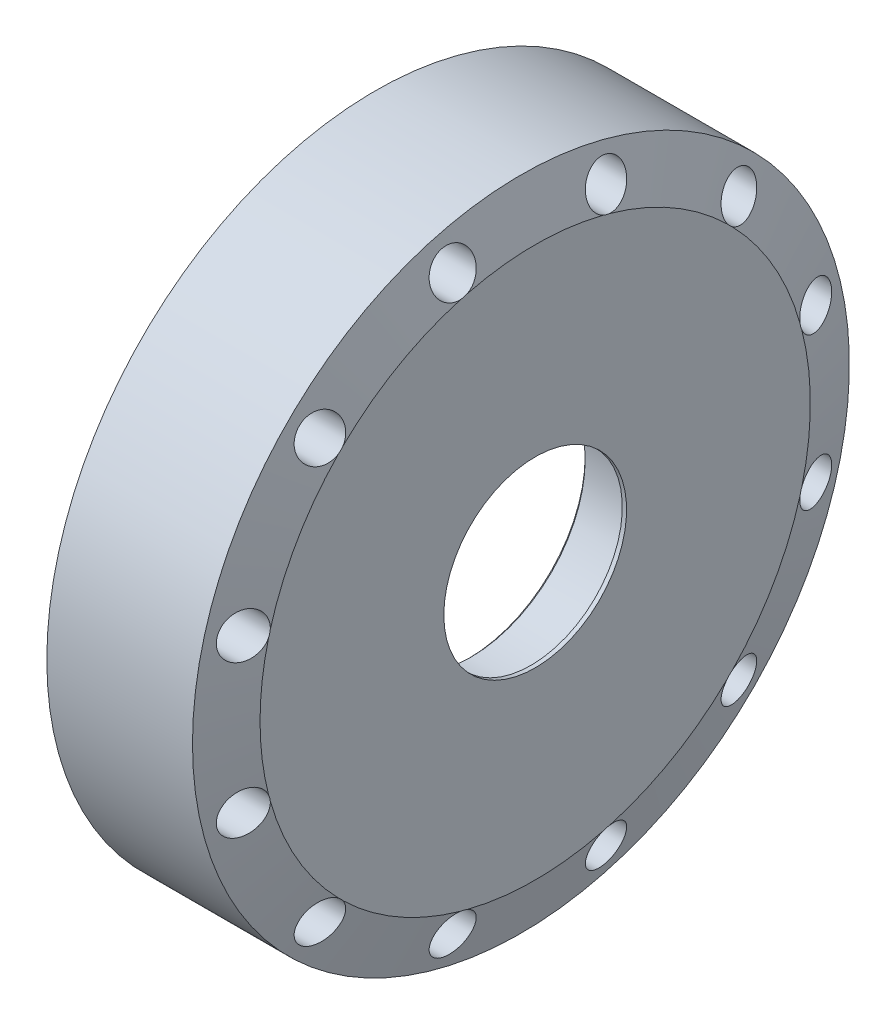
from build123d import *

# Parameters (mm, degrees)
ENL_V_MAT_EXTRU_1_DEPTH                            = 40
ESQUISSE3_R                                        = 37.5
ENL_V_MAT_EXTRU_2_DEPTH                            = 37
CHANFREIN1_SIZE                                    = 2
CHANFREIN1_SIZE2                                   = 1.154700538
ESQUISSE4_R                                        = 9.5
ENL_V_MAT_EXTRU_3_DEPTH                            = 1.8
R_P_TITION_LIN_AIRE1_COUNT                         = 2
R_P_TITION_LIN_AIRE1_PITCH                         = 86
R_P_TITION_LIN_AIRE1_COUNT_DIR2                    = 2
R_P_TITION_LIN_AIRE1_PITCH_DIR2                    = 40
CHANFREIN2_SIZE                                    = 2
CHANFREIN3_SIZE                                    = 2.5
CHANFREIN3_SIZE2                                   = 1.443375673
R_P_TITION_CIRCULAIRE1_COUNT                       = 6
CHANFREIN1_OF_R_P_TITION_CIRCULAIRE1_SIZE2         = 2
CHANFREIN1_OF_R_P_TITION_CIRCULAIRE1_SIZE          = 1.154700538
CHAMBRAGE_POUR_VIS_T_TE_HEXAGONALE_M16_D           = 18
CHAMBRAGE_POUR_VIS_T_TE_HEXAGONALE_M16_CBORE_D     = 30
CHAMBRAGE_POUR_VIS_T_TE_HEXAGONALE_M16_CBORE_DEPTH = 45
R_P_TITION_CIRCULAIRE2_COUNT                       = 12


with BuildPart() as part:
    # Esquisse1 → R_volution1 (revolve)
    with BuildSketch(Plane.XY, mode=Mode.PRIVATE) as r_volution1_sk:
        Polygon((0, 222.5), (0, 230), (102, 230), (112, 192.679491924), (112, 64), (109, 64), (109, 72.5), (105, 72.5), (105, 80), (65, 80), (65, 196.5), (7, 196.5), (7, 222.5), align=None)
    revolve(r_volution1_sk.sketch.rotate(Axis((0, 0, 0), (1, 0, 0)), 90), axis=Axis((0, 0, 0), (1, 0, 0)))

    # Esquisse2 → Enl_v. mat.-Extru.1 (cut)
    with BuildSketch(Plane.ZY.offset(-7)):
        with BuildLine():
            Line((193.597385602, -88.679491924), (169.791986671, -74.935438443))
            Line((169.791986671, -74.935438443), (149.791986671, -109.576454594))
            Line((149.791986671, -109.576454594), (173.597385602, -123.320508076))
            ThreePointArc((173.597385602, -123.320508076), (179.667937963, -124.119711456), (184.525588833, -120.392304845))
            Line((184.525588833, -120.392304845), (196.525588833, -99.607695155))
            ThreePointArc((196.525588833, -99.607695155), (197.324792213, -93.537142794), (193.597385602, -88.679491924))
        make_face()
        with BuildLine():
            Line((-12, 220), (12, 220))
            ThreePointArc((12, 220), (17.656854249, 217.656854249), (20, 212))
            Line((20, 212), (20, 184.511893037))
            Line((20, 184.511893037), (-20, 184.511893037))
            Line((-20, 184.511893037), (-20, 212))
            ThreePointArc((-20, 212), (-17.656854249, 217.656854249), (-12, 220))
        make_face()
        with BuildLine():
            Line((-173.597385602, -123.320508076), (-149.791986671, -109.576454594))
            Line((-149.791986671, -109.576454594), (-169.791986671, -74.935438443))
            Line((-169.791986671, -74.935438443), (-193.597385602, -88.679491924))
            ThreePointArc((-193.597385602, -88.679491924), (-197.324792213, -93.537142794), (-196.525588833, -99.607695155))
            Line((-196.525588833, -99.607695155), (-184.525588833, -120.392304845))
            ThreePointArc((-184.525588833, -120.392304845), (-179.667937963, -124.119711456), (-173.597385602, -123.320508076))
        make_face()
    extrude(amount=-ENL_V_MAT_EXTRU_1_DEPTH, mode=Mode.SUBTRACT)

    # Esquisse3 → Enl_v. mat.-Extru.2 (cut)
    with BuildSketch(Plane.ZY.offset(-65)):
        with Locations((0, 155)):
            Circle(ESQUISSE3_R)
    enl_v_mat_extru_2 = extrude(amount=-ENL_V_MAT_EXTRU_2_DEPTH, mode=Mode.SUBTRACT)

    # Chanfrein1
    chanfrein1_edges = [part.edges().sort_by_distance(p)[0] for p in [
        (65, 155, -37.5),
    ]]
    chanfrein1_side = [part.faces().sort_by_distance(p)[0] for p in [
        (83.5, 155, -37.5),
    ]]
    chamfer(chanfrein1_edges, length=CHANFREIN1_SIZE, length2=CHANFREIN1_SIZE2, reference=chanfrein1_side[0])

    # Esquisse4 → Enl_v. mat.-Extru.3 (cut)
    with BuildSketch(Plane.ZY.offset(-65)):
        with Locations((0, 95)):
            Circle(ESQUISSE4_R)
    enl_v_mat_extru_3 = extrude(amount=-ENL_V_MAT_EXTRU_3_DEPTH, mode=Mode.SUBTRACT)

    # Esquisse7 → Enl_vement de mati_re-R_volution1 (revolve, cut)
    with BuildSketch(Plane(origin=(-24.88620668, 43.104174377, 0), x_dir=(0, 0, 1), z_dir=(0.5000000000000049, -0.8660254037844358, 0)), mode=Mode.PRIVATE) as enl_vement_de_mati_re_r_volution1_sk:
        Polygon((3, -98.240995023), (3, -150.059600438), (0, -151.791651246), (0, -98.240995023), align=None)
    enl_vement_de_mati_re_r_volution1 = revolve(enl_vement_de_mati_re_r_volution1_sk.sketch.rotate(Axis((65, 95, 0), (-0.8660254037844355, -0.5000000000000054, 0)), 90), axis=Axis((65, 95, 0), (-0.8660254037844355, -0.5000000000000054, 0)), mode=Mode.SUBTRACT)

    # Esquisse8 → Trou taraud_ M81 (revolve, cut)
    with BuildSketch(Plane(origin=(65, 135, 43), x_dir=(0, 0, 1), z_dir=(0, 1, 0))):
        Polygon((0, 0), (0, 32.042926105), (3.4, 30), (3.4, 0), align=None)
    trou_taraud_m81 = revolve(axis=Axis((58.65, 135, 43), (1, 0, 0)), mode=Mode.SUBTRACT)

    # R_p_tition lin_aire1: Trou taraud_ M81 2 × 2
    with Locations(*[(0, j * R_P_TITION_LIN_AIRE1_PITCH_DIR2, -i * R_P_TITION_LIN_AIRE1_PITCH) for i in range(R_P_TITION_LIN_AIRE1_COUNT) for j in range(R_P_TITION_LIN_AIRE1_COUNT_DIR2) if (i, j) != (0, 0)]):
        add(trou_taraud_m81, mode=Mode.SUBTRACT)

    # Chanfrein2
    chanfrein2_edges = [part.edges().sort_by_distance(p)[0] for p in [
        (65, 0, -80),
    ]]
    chamfer(chanfrein2_edges, length=CHANFREIN2_SIZE)

    # Chanfrein3
    chanfrein3_edges = [part.edges().sort_by_distance(p)[0] for p in [
        (0, 0, -222.5),
    ]]
    chanfrein3_side = [part.faces().sort_by_distance(p)[0] for p in [
        (3.5, 0, -222.5),
    ]]
    chamfer(chanfrein3_edges, length=CHANFREIN3_SIZE, length2=CHANFREIN3_SIZE2, reference=chanfrein3_side[0])

    # Esquisse11 → Trou taraud_ M82 (revolve, cut)
    with BuildSketch(Plane(origin=(65, 91.762953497, -24.587809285), x_dir=(0, 0, 1), z_dir=(0, 1, 0))):
        Polygon((0, 0), (0, 32.042926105), (3.4, 30), (3.4, 0), align=None)
    trou_taraud_m82 = revolve(axis=Axis((58.65, 91.762953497, -24.587809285), (1, 0, 0)), mode=Mode.SUBTRACT)

    # Esquisse13 → Trou taraud_ M83 (revolve, cut)
    with BuildSketch(Plane(origin=(65, 91.762953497, 24.587809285), x_dir=(0, 0, 1), z_dir=(0, 1, 0))):
        Polygon((0, 0), (0, 32.042926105), (3.4, 30), (3.4, 0), align=None)
    trou_taraud_m83 = revolve(axis=Axis((58.65, 91.762953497, 24.587809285), (1, 0, 0)), mode=Mode.SUBTRACT)

    # R_p_tition circulaire1: Enl_v. mat.-Extru.2, Enl_v. mat.-Extru.3, Enl_vement de mati_re-R_volution1, Trou taraud_ M81, Trou taraud_ M82, Trou taraud_ M83 ×6 about axis
    r_p_tition_circulaire1_axis = Axis((0, 0, 0), (1, 0, 0))
    add([enl_v_mat_extru_2.rotate(r_p_tition_circulaire1_axis, i * 360 / R_P_TITION_CIRCULAIRE1_COUNT) for i in range(1, R_P_TITION_CIRCULAIRE1_COUNT)], mode=Mode.SUBTRACT)
    add([enl_v_mat_extru_3.rotate(r_p_tition_circulaire1_axis, i * 360 / R_P_TITION_CIRCULAIRE1_COUNT) for i in range(1, R_P_TITION_CIRCULAIRE1_COUNT)], mode=Mode.SUBTRACT)
    add([enl_vement_de_mati_re_r_volution1.rotate(r_p_tition_circulaire1_axis, i * 360 / R_P_TITION_CIRCULAIRE1_COUNT) for i in range(1, R_P_TITION_CIRCULAIRE1_COUNT)], mode=Mode.SUBTRACT)
    add([trou_taraud_m81.rotate(r_p_tition_circulaire1_axis, i * 360 / R_P_TITION_CIRCULAIRE1_COUNT) for i in range(1, R_P_TITION_CIRCULAIRE1_COUNT)], mode=Mode.SUBTRACT)
    add([trou_taraud_m82.rotate(r_p_tition_circulaire1_axis, i * 360 / R_P_TITION_CIRCULAIRE1_COUNT) for i in range(1, R_P_TITION_CIRCULAIRE1_COUNT)], mode=Mode.SUBTRACT)
    add([trou_taraud_m83.rotate(r_p_tition_circulaire1_axis, i * 360 / R_P_TITION_CIRCULAIRE1_COUNT) for i in range(1, R_P_TITION_CIRCULAIRE1_COUNT)], mode=Mode.SUBTRACT)

    # R_p_tition circulaire1 copy 1 sketch → R_p_tition circulaire1 copy 1 (revolve, cut)
    with BuildSketch(Plane(origin=(65, 50.260907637, 173.054445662), x_dir=(0, -0.8660254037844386, 0.5000000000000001), z_dir=(0, 0.5000000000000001, 0.8660254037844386))):
        Polygon((0, 0), (0, 32.042926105), (3.4, 30), (3.4, 0), align=None)
    revolve(axis=Axis((58.65, 50.260907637, 173.054445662), (1, 0, 0)), mode=Mode.SUBTRACT)

    # R_p_tition circulaire1 copy 2 sketch → R_p_tition circulaire1 copy 2 (revolve, cut)
    with BuildSketch(Plane(origin=(65, -124.739092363, 130.054445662), x_dir=(0, -0.8660254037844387, -0.4999999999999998), z_dir=(0, -0.4999999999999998, 0.8660254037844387))):
        Polygon((0, 0), (0, 32.042926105), (3.4, 30), (3.4, 0), align=None)
    revolve(axis=Axis((58.65, -124.739092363, 130.054445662), (1, 0, 0)), mode=Mode.SUBTRACT)

    # R_p_tition circulaire1 copy 3 sketch → R_p_tition circulaire1 copy 3 (revolve, cut)
    with BuildSketch(Plane(origin=(65, -175, -43), x_dir=(0, 0, -1), z_dir=(0, -1, 0))):
        Polygon((0, 0), (0, 32.042926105), (3.4, 30), (3.4, 0), align=None)
    revolve(axis=Axis((58.65, -175, -43), (1, 0, 0)), mode=Mode.SUBTRACT)

    # R_p_tition circulaire1 copy 4 sketch → R_p_tition circulaire1 copy 4 (revolve, cut)
    with BuildSketch(Plane(origin=(65, -50.260907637, -173.054445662), x_dir=(0, 0.8660254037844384, -0.5000000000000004), z_dir=(0, -0.5000000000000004, -0.8660254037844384))):
        Polygon((0, 0), (0, 32.042926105), (3.4, 30), (3.4, 0), align=None)
    revolve(axis=Axis((58.65, -50.260907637, -173.054445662), (1, 0, 0)), mode=Mode.SUBTRACT)

    # R_p_tition circulaire1 copy 5 sketch → R_p_tition circulaire1 copy 5 (revolve, cut)
    with BuildSketch(Plane(origin=(65, 124.739092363, -130.054445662), x_dir=(0, 0.8660254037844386, 0.5000000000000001), z_dir=(0, 0.5000000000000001, -0.8660254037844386))):
        Polygon((0, 0), (0, 32.042926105), (3.4, 30), (3.4, 0), align=None)
    revolve(axis=Axis((58.65, 124.739092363, -130.054445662), (1, 0, 0)), mode=Mode.SUBTRACT)

    # R_p_tition circulaire1 copy 6 sketch → R_p_tition circulaire1 copy 6 (revolve, cut)
    with BuildSketch(Plane(origin=(65, 104.739092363, 95.413429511), x_dir=(0, -0.8660254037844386, 0.5000000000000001), z_dir=(0, 0.5000000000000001, 0.8660254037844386))):
        Polygon((0, 0), (0, 32.042926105), (3.4, 30), (3.4, 0), align=None)
    revolve(axis=Axis((58.65, 104.739092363, 95.413429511), (1, 0, 0)), mode=Mode.SUBTRACT)

    # R_p_tition circulaire1 copy 7 sketch → R_p_tition circulaire1 copy 7 (revolve, cut)
    with BuildSketch(Plane(origin=(65, -30.260907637, 138.413429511), x_dir=(0, -0.8660254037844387, -0.4999999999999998), z_dir=(0, -0.4999999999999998, 0.8660254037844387))):
        Polygon((0, 0), (0, 32.042926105), (3.4, 30), (3.4, 0), align=None)
    revolve(axis=Axis((58.65, -30.260907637, 138.413429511), (1, 0, 0)), mode=Mode.SUBTRACT)

    # R_p_tition circulaire1 copy 8 sketch → R_p_tition circulaire1 copy 8 (revolve, cut)
    with BuildSketch(Plane(origin=(65, -135, 43), x_dir=(0, 0, -1), z_dir=(0, -1, 0))):
        Polygon((0, 0), (0, 32.042926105), (3.4, 30), (3.4, 0), align=None)
    revolve(axis=Axis((58.65, -135, 43), (1, 0, 0)), mode=Mode.SUBTRACT)

    # R_p_tition circulaire1 copy 9 sketch → R_p_tition circulaire1 copy 9 (revolve, cut)
    with BuildSketch(Plane(origin=(65, -104.739092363, -95.413429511), x_dir=(0, 0.8660254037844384, -0.5000000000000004), z_dir=(0, -0.5000000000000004, -0.8660254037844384))):
        Polygon((0, 0), (0, 32.042926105), (3.4, 30), (3.4, 0), align=None)
    revolve(axis=Axis((58.65, -104.739092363, -95.413429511), (1, 0, 0)), mode=Mode.SUBTRACT)

    # R_p_tition circulaire1 copy 10 sketch → R_p_tition circulaire1 copy 10 (revolve, cut)
    with BuildSketch(Plane(origin=(65, 30.260907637, -138.413429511), x_dir=(0, 0.8660254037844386, 0.5000000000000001), z_dir=(0, 0.5000000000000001, -0.8660254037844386))):
        Polygon((0, 0), (0, 32.042926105), (3.4, 30), (3.4, 0), align=None)
    revolve(axis=Axis((58.65, 30.260907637, -138.413429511), (1, 0, 0)), mode=Mode.SUBTRACT)

    # R_p_tition circulaire1 copy 11 sketch → R_p_tition circulaire1 copy 11 (revolve, cut)
    with BuildSketch(Plane(origin=(65, 124.739092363, 130.054445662), x_dir=(0, -0.8660254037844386, 0.5000000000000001), z_dir=(0, 0.5000000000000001, 0.8660254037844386))):
        Polygon((0, 0), (0, 32.042926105), (3.4, 30), (3.4, 0), align=None)
    revolve(axis=Axis((58.65, 124.739092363, 130.054445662), (1, 0, 0)), mode=Mode.SUBTRACT)

    # R_p_tition circulaire1 copy 12 sketch → R_p_tition circulaire1 copy 12 (revolve, cut)
    with BuildSketch(Plane(origin=(65, -50.260907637, 173.054445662), x_dir=(0, -0.8660254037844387, -0.4999999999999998), z_dir=(0, -0.4999999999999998, 0.8660254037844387))):
        Polygon((0, 0), (0, 32.042926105), (3.4, 30), (3.4, 0), align=None)
    revolve(axis=Axis((58.65, -50.260907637, 173.054445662), (1, 0, 0)), mode=Mode.SUBTRACT)

    # R_p_tition circulaire1 copy 13 sketch → R_p_tition circulaire1 copy 13 (revolve, cut)
    with BuildSketch(Plane(origin=(65, -175, 43), x_dir=(0, 0, -1), z_dir=(0, -1, 0))):
        Polygon((0, 0), (0, 32.042926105), (3.4, 30), (3.4, 0), align=None)
    revolve(axis=Axis((58.65, -175, 43), (1, 0, 0)), mode=Mode.SUBTRACT)

    # R_p_tition circulaire1 copy 14 sketch → R_p_tition circulaire1 copy 14 (revolve, cut)
    with BuildSketch(Plane(origin=(65, -124.739092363, -130.054445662), x_dir=(0, 0.8660254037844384, -0.5000000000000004), z_dir=(0, -0.5000000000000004, -0.8660254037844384))):
        Polygon((0, 0), (0, 32.042926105), (3.4, 30), (3.4, 0), align=None)
    revolve(axis=Axis((58.65, -124.739092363, -130.054445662), (1, 0, 0)), mode=Mode.SUBTRACT)

    # R_p_tition circulaire1 copy 15 sketch → R_p_tition circulaire1 copy 15 (revolve, cut)
    with BuildSketch(Plane(origin=(65, 50.260907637, -173.054445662), x_dir=(0, 0.8660254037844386, 0.5000000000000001), z_dir=(0, 0.5000000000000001, -0.8660254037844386))):
        Polygon((0, 0), (0, 32.042926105), (3.4, 30), (3.4, 0), align=None)
    revolve(axis=Axis((58.65, 50.260907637, -173.054445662), (1, 0, 0)), mode=Mode.SUBTRACT)

    # Chanfrein1 of R_p_tition circulaire1
    chanfrein1_of_r_p_tition_circulaire1_edges = [part.edges().sort_by_distance(p)[0] for p in [
        (65, 109.975952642, 115.483937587),
        (65, -45.024047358, 152.983937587),
        (65, -155, 37.5),
        (65, -109.975952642, -115.483937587),
        (65, 45.024047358, -152.983937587),
    ]]
    chamfer(chanfrein1_of_r_p_tition_circulaire1_edges, length=CHANFREIN1_OF_R_P_TITION_CIRCULAIRE1_SIZE, length2=CHANFREIN1_OF_R_P_TITION_CIRCULAIRE1_SIZE2)

    # Chambrage pour vis _ t_te hexagonale M16 (through all)
    with Locations(Plane(origin=(112, 0, 0), x_dir=(0, 0, -1), z_dir=(1, 0, 0))):
        with Locations((53.704951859, 200.429608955)):
            chambrage_pour_vis_t_te_hexagonale_m16 = CounterBoreHole(CHAMBRAGE_POUR_VIS_T_TE_HEXAGONALE_M16_D / 2, CHAMBRAGE_POUR_VIS_T_TE_HEXAGONALE_M16_CBORE_D / 2, CHAMBRAGE_POUR_VIS_T_TE_HEXAGONALE_M16_CBORE_DEPTH)

    # R_p_tition circulaire2: Chambrage pour vis _ t_te hexagonale M16 ×12 about axis
    r_p_tition_circulaire2_axis = Axis((0, 0, 0), (1, 0, 0))
    for i in range(1, R_P_TITION_CIRCULAIRE2_COUNT):
        add(chambrage_pour_vis_t_te_hexagonale_m16.rotate(r_p_tition_circulaire2_axis, i * 360 / R_P_TITION_CIRCULAIRE2_COUNT), mode=Mode.SUBTRACT)


solid = part.part
